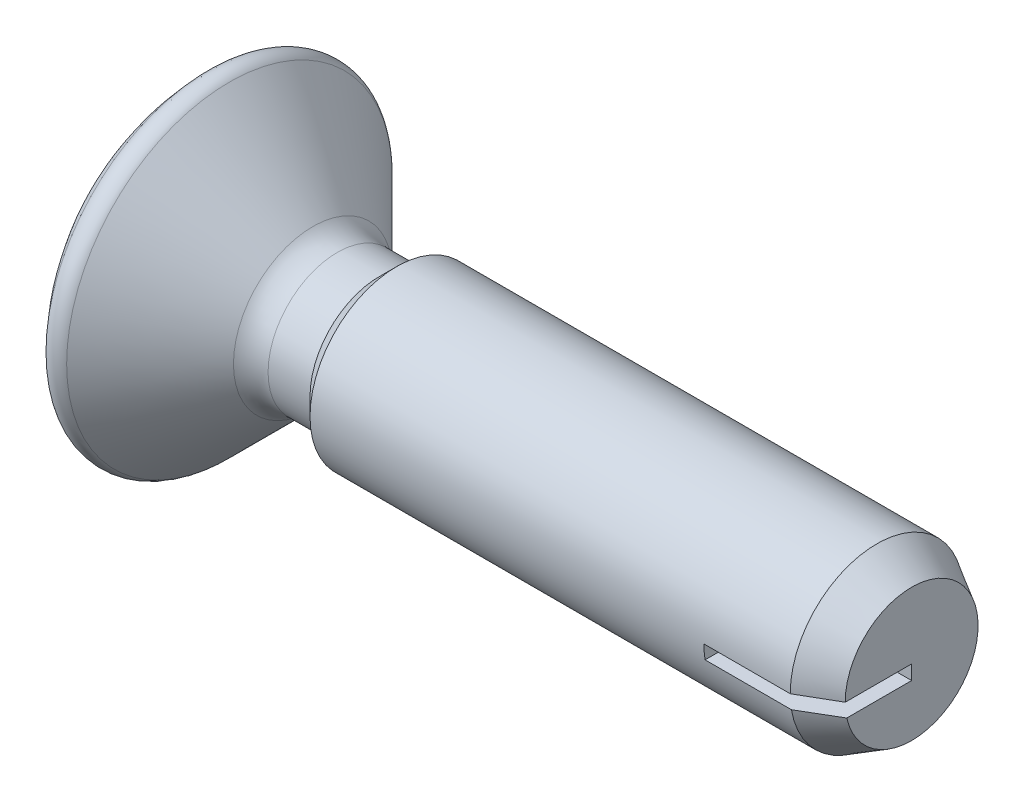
ISO-10303-21;
HEADER;
FILE_DESCRIPTION(('STEP AP214'),'2;1');
FILE_NAME('part.step','',(''),(''),'','','');
FILE_SCHEMA(('AUTOMOTIVE_DESIGN { 1 0 10303 214 1 1 1 1 }'));
ENDSEC;
DATA;
#1=APPLICATION_CONTEXT('core data for automotive mechanical design processes');
#2=APPLICATION_PROTOCOL_DEFINITION('international standard','automotive_design',2000,#1);
#3=PRODUCT_CONTEXT('',#1,'mechanical');
#4=PRODUCT('Part','Part','',(#3));
#5=PRODUCT_RELATED_PRODUCT_CATEGORY('part','',(#4));
#6=PRODUCT_DEFINITION_FORMATION('','',#4);
#7=PRODUCT_DEFINITION_CONTEXT('part definition',#1,'design');
#8=PRODUCT_DEFINITION('design','',#6,#7);
#9=PRODUCT_DEFINITION_SHAPE('','',#8);
#10=(LENGTH_UNIT() NAMED_UNIT(*) SI_UNIT(.MILLI.,.METRE.));
#11=(NAMED_UNIT(*) PLANE_ANGLE_UNIT() SI_UNIT($,.RADIAN.));
#12=(NAMED_UNIT(*) SI_UNIT($,.STERADIAN.) SOLID_ANGLE_UNIT());
#13=UNCERTAINTY_MEASURE_WITH_UNIT(LENGTH_MEASURE(1.E-05),#10,'distance_accuracy_value','');
#14=(GEOMETRIC_REPRESENTATION_CONTEXT(3) GLOBAL_UNCERTAINTY_ASSIGNED_CONTEXT((#13)) GLOBAL_UNIT_ASSIGNED_CONTEXT((#10,
#11,#12)) REPRESENTATION_CONTEXT('',''));
#15=CARTESIAN_POINT('',(0.,0.,0.));
#16=DIRECTION('',(0.,0.,1.));
#17=DIRECTION('',(1.,0.,0.));
#18=AXIS2_PLACEMENT_3D('',#15,#16,#17);
#19=CARTESIAN_POINT('',(0.,0.,0.));
#20=DIRECTION('',(-1.,0.,0.));
#21=DIRECTION('',(0.,0.,1.));
#22=AXIS2_PLACEMENT_3D('',#19,#20,#21);
#23=CYLINDRICAL_SURFACE('',#22,2.);
#24=CARTESIAN_POINT('',(4.1,0.,0.));
#25=DIRECTION('',(-1.,0.,0.));
#26=DIRECTION('',(0.,0.,1.));
#27=AXIS2_PLACEMENT_3D('',#24,#25,#26);
#28=CIRCLE('',#27,2.);
#29=CARTESIAN_POINT('',(4.1,0.,2.));
#30=VERTEX_POINT('',#29);
#31=EDGE_CURVE('E161',#30,#30,#28,.T.);
#32=ORIENTED_EDGE('',*,*,#31,.F.);
#33=EDGE_LOOP('',(#32));
#34=FACE_BOUND('',#33,.T.);
#35=DIRECTION('',(-1.,0.,0.));
#36=VECTOR('',#35,1.);
#37=CARTESIAN_POINT('',(0.,0.,2.));
#38=LINE('',#37,#36);
#39=CARTESIAN_POINT('',(15.1945963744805,0.,2.));
#40=VERTEX_POINT('',#39);
#41=CARTESIAN_POINT('',(13.2,0.,2.));
#42=VERTEX_POINT('',#41);
#43=EDGE_CURVE('E187',#40,#42,#38,.T.);
#44=ORIENTED_EDGE('',*,*,#43,.F.);
#45=CARTESIAN_POINT('',(15.1945963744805,0.,0.));
#46=DIRECTION('',(-1.,0.,0.));
#47=DIRECTION('',(0.,0.,1.));
#48=AXIS2_PLACEMENT_3D('',#45,#46,#47);
#49=CIRCLE('',#48,2.);
#50=CARTESIAN_POINT('',(15.1945963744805,-0.333333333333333,1.97202659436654));
#51=VERTEX_POINT('',#50);
#52=EDGE_CURVE('E184',#40,#51,#49,.T.);
#53=ORIENTED_EDGE('',*,*,#52,.T.);
#54=DIRECTION('',(-1.,0.,0.));
#55=VECTOR('',#54,1.);
#56=CARTESIAN_POINT('',(0.,-0.333333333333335,1.97202659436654));
#57=LINE('',#56,#55);
#58=CARTESIAN_POINT('',(13.2,-0.333333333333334,1.97202659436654));
#59=VERTEX_POINT('',#58);
#60=EDGE_CURVE('E191',#59,#51,#57,.F.);
#61=ORIENTED_EDGE('',*,*,#60,.F.);
#62=CARTESIAN_POINT('',(13.2,0.,0.));
#63=DIRECTION('',(1.,0.,0.));
#64=DIRECTION('',(0.,0.,-1.));
#65=AXIS2_PLACEMENT_3D('',#62,#63,#64);
#66=CIRCLE('',#65,2.);
#67=EDGE_CURVE('E43',#42,#59,#66,.T.);
#68=ORIENTED_EDGE('',*,*,#67,.F.);
#69=EDGE_LOOP('',(#44,#53,#61,#68));
#70=FACE_BOUND('',#69,.T.);
#71=ADVANCED_FACE('F70',(#34,#70),#23,.T.);
#72=CARTESIAN_POINT('',(15.1945963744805,0.,0.));
#73=DIRECTION('',(-1.,0.,0.));
#74=DIRECTION('',(0.,0.,1.));
#75=AXIS2_PLACEMENT_3D('',#72,#73,#74);
#76=CONICAL_SURFACE('',#75,2.,0.523598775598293);
#77=ORIENTED_EDGE('',*,*,#52,.F.);
#78=DIRECTION('',(-0.866025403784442,0.,0.499999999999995));
#79=VECTOR('',#78,1.);
#80=CARTESIAN_POINT('',(18.6586979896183,0.,0.));
#81=LINE('',#80,#79);
#82=CARTESIAN_POINT('',(16.,0.,1.535));
#83=VERTEX_POINT('',#82);
#84=EDGE_CURVE('E189',#40,#83,#81,.F.);
#85=ORIENTED_EDGE('',*,*,#84,.T.);
#86=CARTESIAN_POINT('',(16.,0.,0.));
#87=DIRECTION('',(-1.,0.,0.));
#88=DIRECTION('',(0.,0.,1.));
#89=AXIS2_PLACEMENT_3D('',#86,#87,#88);
#90=CIRCLE('',#89,1.535);
#91=CARTESIAN_POINT('',(16.,-0.333333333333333,1.49837041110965));
#92=VERTEX_POINT('',#91);
#93=EDGE_CURVE('E147',#83,#92,#90,.T.);
#94=ORIENTED_EDGE('',*,*,#93,.T.);
#95=CARTESIAN_POINT('',(17.7245765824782,-0.333333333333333,0.423969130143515));
#96=CARTESIAN_POINT('',(17.7003740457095,-0.333333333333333,0.441731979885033));
#97=CARTESIAN_POINT('',(17.6759825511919,-0.333333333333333,0.459232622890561));
#98=CARTESIAN_POINT('',(17.6269078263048,-0.333333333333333,0.49381503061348));
#99=CARTESIAN_POINT('',(17.6022246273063,-0.333333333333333,0.510896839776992));
#100=CARTESIAN_POINT('',(17.5278722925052,-0.333333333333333,0.561668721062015));
#101=CARTESIAN_POINT('',(17.4778872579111,-0.333333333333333,0.594894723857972));
#102=CARTESIAN_POINT('',(17.3774348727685,-0.333333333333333,0.660556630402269));
#103=CARTESIAN_POINT('',(17.3269677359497,-0.333333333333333,0.692992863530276));
#104=CARTESIAN_POINT('',(17.2256954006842,-0.333333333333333,0.757342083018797));
#105=CARTESIAN_POINT('',(17.1748901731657,-0.333333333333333,0.789255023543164));
#106=CARTESIAN_POINT('',(17.0279577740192,-0.333333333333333,0.880817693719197));
#107=CARTESIAN_POINT('',(16.9315407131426,-0.333333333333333,0.940001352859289));
#108=CARTESIAN_POINT('',(16.7382584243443,-0.333333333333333,1.0576330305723));
#109=CARTESIAN_POINT('',(16.6413931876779,-0.333333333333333,1.11608103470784));
#110=CARTESIAN_POINT('',(16.3503178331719,-0.333333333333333,1.29078741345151));
#111=CARTESIAN_POINT('',(16.1556992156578,-0.333333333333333,1.40636454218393));
#112=CARTESIAN_POINT('',(15.8117855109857,-0.333333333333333,1.60961313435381));
#113=CARTESIAN_POINT('',(15.6625918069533,-0.333333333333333,1.69745704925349));
#114=CARTESIAN_POINT('',(15.3640150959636,-0.333333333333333,1.87282276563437));
#115=CARTESIAN_POINT('',(15.2146320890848,-0.333333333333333,1.96034456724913));
#116=CARTESIAN_POINT('',(14.9158541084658,-0.333333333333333,2.1351138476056));
#117=CARTESIAN_POINT('',(14.7664592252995,-0.333333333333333,2.22236148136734));
#118=CARTESIAN_POINT('',(14.467580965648,-0.333333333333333,2.3967043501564));
#119=CARTESIAN_POINT('',(14.318097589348,-0.333333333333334,2.48379958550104));
#120=CARTESIAN_POINT('',(14.1685865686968,-0.333333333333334,2.5708472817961));
#121=B_SPLINE_CURVE_WITH_KNOTS('',3,(#95,#96,#97,#98,#99,#100,#101,#102,#103,#104,#105,#106,
#107,#108,#109,#110,#111,#112,#113,#114,#115,#116,#117,#118,#119,#120),.UNSPECIFIED.,.F.,.F.,(4,
2,2,2,2,2,2,2,2,2,2,2,4),(0.,0.0900582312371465,0.180106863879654,0.360155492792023,
0.540127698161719,0.720115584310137,1.05950608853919,1.39890324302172,2.07794788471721,
2.59734938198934,3.11675066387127,3.63576777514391,4.15478380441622),.UNSPECIFIED.);
#122=EDGE_CURVE('E193',#92,#51,#121,.T.);
#123=ORIENTED_EDGE('',*,*,#122,.T.);
#124=EDGE_LOOP('',(#77,#85,#94,#123));
#125=FACE_BOUND('',#124,.T.);
#126=ADVANCED_FACE('F203',(#125),#76,.T.);
#127=CARTESIAN_POINT('',(16.,2.,0.));
#128=DIRECTION('',(-1.,0.,0.));
#129=DIRECTION('',(0.,0.,1.));
#130=AXIS2_PLACEMENT_3D('',#127,#128,#129);
#131=PLANE('',#130);
#132=DIRECTION('',(0.,0.,1.));
#133=VECTOR('',#132,1.);
#134=CARTESIAN_POINT('',(16.,0.,0.));
#135=LINE('',#134,#133);
#136=CARTESIAN_POINT('',(16.,0.,0.));
#137=VERTEX_POINT('',#136);
#138=EDGE_CURVE('E78',#137,#83,#135,.T.);
#139=ORIENTED_EDGE('',*,*,#138,.F.);
#140=DIRECTION('',(0.,1.,0.));
#141=VECTOR('',#140,1.);
#142=CARTESIAN_POINT('',(16.,0.,0.));
#143=LINE('',#142,#141);
#144=CARTESIAN_POINT('',(16.,-0.333333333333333,0.));
#145=VERTEX_POINT('',#144);
#146=EDGE_CURVE('E137',#145,#137,#143,.T.);
#147=ORIENTED_EDGE('',*,*,#146,.F.);
#148=DIRECTION('',(0.,0.,-1.));
#149=VECTOR('',#148,1.);
#150=CARTESIAN_POINT('',(16.,-0.333333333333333,0.));
#151=LINE('',#150,#149);
#152=EDGE_CURVE('E148',#92,#145,#151,.T.);
#153=ORIENTED_EDGE('',*,*,#152,.F.);
#154=ORIENTED_EDGE('',*,*,#93,.F.);
#155=EDGE_LOOP('',(#139,#147,#153,#154));
#156=FACE_BOUND('',#155,.T.);
#157=ADVANCED_FACE('F145',(#156),#131,.F.);
#158=CARTESIAN_POINT('',(3.75756413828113,0.,0.));
#159=DIRECTION('',(-1.,0.,0.));
#160=DIRECTION('',(0.,1.,0.));
#161=AXIS2_PLACEMENT_3D('',#158,#159,#160);
#162=SPHERICAL_SURFACE('',#161,5.48810424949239);
#163=CARTESIAN_POINT('',(-0.730540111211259,0.,0.));
#164=DIRECTION('',(1.,0.,0.));
#165=DIRECTION('',(0.,0.,-1.));
#166=AXIS2_PLACEMENT_3D('',#163,#164,#165);
#167=CIRCLE('',#166,3.15851365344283);
#168=CARTESIAN_POINT('',(-0.730540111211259,-0.6,-3.1010012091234));
#169=VERTEX_POINT('',#168);
#170=CARTESIAN_POINT('',(-0.730540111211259,0.6,-3.1010012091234));
#171=VERTEX_POINT('',#170);
#172=EDGE_CURVE('E155',#169,#171,#167,.T.);
#173=ORIENTED_EDGE('',*,*,#172,.T.);
#174=CARTESIAN_POINT('',(3.75756413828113,0.6,0.));
#175=DIRECTION('',(0.,1.,0.));
#176=DIRECTION('',(0.,0.,1.));
#177=AXIS2_PLACEMENT_3D('',#174,#175,#176);
#178=CIRCLE('',#177,5.45520744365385);
#179=CARTESIAN_POINT('',(-0.730540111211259,0.6,3.1010012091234));
#180=VERTEX_POINT('',#179);
#181=EDGE_CURVE('E149',#171,#180,#178,.T.);
#182=ORIENTED_EDGE('',*,*,#181,.T.);
#183=CARTESIAN_POINT('',(-0.730540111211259,-0.6,3.1010012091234));
#184=VERTEX_POINT('',#183);
#185=EDGE_CURVE('E154',#180,#184,#167,.T.);
#186=ORIENTED_EDGE('',*,*,#185,.T.);
#187=CARTESIAN_POINT('',(3.75756413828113,-0.6,0.));
#188=DIRECTION('',(0.,-1.,0.));
#189=DIRECTION('',(0.,0.,-1.));
#190=AXIS2_PLACEMENT_3D('',#187,#188,#189);
#191=CIRCLE('',#190,5.45520744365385);
#192=EDGE_CURVE('E158',#184,#169,#191,.T.);
#193=ORIENTED_EDGE('',*,*,#192,.T.);
#194=EDGE_LOOP('',(#173,#182,#186,#193));
#195=FACE_BOUND('',#194,.T.);
#196=CARTESIAN_POINT('',(-0.246219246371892,0.,0.));
#197=DIRECTION('',(-1.,0.,0.));
#198=DIRECTION('',(0.,0.,1.));
#199=AXIS2_PLACEMENT_3D('',#196,#197,#198);
#200=CIRCLE('',#199,3.75353258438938);
#201=CARTESIAN_POINT('',(-0.246219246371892,0.,3.75353258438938));
#202=VERTEX_POINT('',#201);
#203=EDGE_CURVE('E176',#202,#202,#200,.T.);
#204=ORIENTED_EDGE('',*,*,#203,.T.);
#205=EDGE_LOOP('',(#204));
#206=FACE_BOUND('',#205,.T.);
#207=ADVANCED_FACE('F72',(#195,#206),#162,.T.);
#208=CARTESIAN_POINT('',(4.1,0.,0.));
#209=DIRECTION('',(1.,0.,0.));
#210=DIRECTION('',(0.,0.,-1.));
#211=AXIS2_PLACEMENT_3D('',#208,#209,#210);
#212=CONICAL_SURFACE('',#211,2.,0.785398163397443);
#213=CARTESIAN_POINT('',(3.7,0.,0.));
#214=DIRECTION('',(-1.,0.,0.));
#215=DIRECTION('',(0.,0.,1.));
#216=AXIS2_PLACEMENT_3D('',#213,#214,#215);
#217=CIRCLE('',#216,1.6);
#218=CARTESIAN_POINT('',(3.7,0.,1.6));
#219=VERTEX_POINT('',#218);
#220=EDGE_CURVE('E164',#219,#219,#217,.T.);
#221=ORIENTED_EDGE('',*,*,#220,.F.);
#222=EDGE_LOOP('',(#221));
#223=FACE_BOUND('',#222,.T.);
#224=ORIENTED_EDGE('',*,*,#31,.T.);
#225=EDGE_LOOP('',(#224));
#226=FACE_BOUND('',#225,.T.);
#227=ADVANCED_FACE('F230',(#223,#226),#212,.T.);
#228=CARTESIAN_POINT('',(0.,0.,0.));
#229=DIRECTION('',(-1.,0.,0.));
#230=DIRECTION('',(0.,0.,1.));
#231=AXIS2_PLACEMENT_3D('',#228,#229,#230);
#232=CYLINDRICAL_SURFACE('',#231,1.6);
#233=CARTESIAN_POINT('',(2.73137084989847,0.,0.));
#234=DIRECTION('',(-1.,0.,0.));
#235=DIRECTION('',(0.,0.,1.));
#236=AXIS2_PLACEMENT_3D('',#233,#234,#235);
#237=CIRCLE('',#236,1.6);
#238=CARTESIAN_POINT('',(2.73137084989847,0.,1.6));
#239=VERTEX_POINT('',#238);
#240=EDGE_CURVE('E167',#239,#239,#237,.T.);
#241=ORIENTED_EDGE('',*,*,#240,.F.);
#242=EDGE_LOOP('',(#241));
#243=FACE_BOUND('',#242,.T.);
#244=ORIENTED_EDGE('',*,*,#220,.T.);
#245=EDGE_LOOP('',(#244));
#246=FACE_BOUND('',#245,.T.);
#247=ADVANCED_FACE('F240',(#243,#246),#232,.T.);
#248=CARTESIAN_POINT('',(2.73137084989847,0.,0.));
#249=DIRECTION('',(-1.,0.,0.));
#250=DIRECTION('',(0.,0.,1.));
#251=AXIS2_PLACEMENT_3D('',#248,#249,#250);
#252=TOROIDAL_SURFACE('',#251,2.4,0.8);
#253=CARTESIAN_POINT('',(2.16568542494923,0.,0.));
#254=DIRECTION('',(-1.,0.,0.));
#255=DIRECTION('',(0.,0.,1.));
#256=AXIS2_PLACEMENT_3D('',#253,#254,#255);
#257=CIRCLE('',#256,1.83431457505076);
#258=CARTESIAN_POINT('',(2.16568542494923,0.,1.83431457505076));
#259=VERTEX_POINT('',#258);
#260=EDGE_CURVE('E170',#259,#259,#257,.T.);
#261=ORIENTED_EDGE('',*,*,#260,.F.);
#262=EDGE_LOOP('',(#261));
#263=FACE_BOUND('',#262,.T.);
#264=ORIENTED_EDGE('',*,*,#240,.T.);
#265=EDGE_LOOP('',(#264));
#266=FACE_BOUND('',#265,.T.);
#267=ADVANCED_FACE('F255',(#263,#266),#252,.F.);
#268=CARTESIAN_POINT('',(2.16568542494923,0.,0.));
#269=DIRECTION('',(-1.,0.,0.));
#270=DIRECTION('',(0.,0.,1.));
#271=AXIS2_PLACEMENT_3D('',#268,#269,#270);
#272=CONICAL_SURFACE('',#271,1.83431457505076,0.78539816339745);
#273=CARTESIAN_POINT('',(0.23864853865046,0.,0.));
#274=DIRECTION('',(-1.,0.,0.));
#275=DIRECTION('',(0.,0.,1.));
#276=AXIS2_PLACEMENT_3D('',#273,#274,#275);
#277=CIRCLE('',#276,3.76135146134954);
#278=CARTESIAN_POINT('',(0.23864853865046,0.,3.76135146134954));
#279=VERTEX_POINT('',#278);
#280=EDGE_CURVE('E173',#279,#279,#277,.T.);
#281=ORIENTED_EDGE('',*,*,#280,.F.);
#282=EDGE_LOOP('',(#281));
#283=FACE_BOUND('',#282,.T.);
#284=ORIENTED_EDGE('',*,*,#260,.T.);
#285=EDGE_LOOP('',(#284));
#286=FACE_BOUND('',#285,.T.);
#287=ADVANCED_FACE('F249',(#283,#286),#272,.T.);
#288=CARTESIAN_POINT('',(0.,0.,0.));
#289=DIRECTION('',(-1.,0.,0.));
#290=DIRECTION('',(0.,0.,1.));
#291=AXIS2_PLACEMENT_3D('',#288,#289,#290);
#292=TOROIDAL_SURFACE('',#291,3.52270292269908,0.337499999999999);
#293=ORIENTED_EDGE('',*,*,#203,.F.);
#294=EDGE_LOOP('',(#293));
#295=FACE_BOUND('',#294,.T.);
#296=ORIENTED_EDGE('',*,*,#280,.T.);
#297=EDGE_LOOP('',(#296));
#298=FACE_BOUND('',#297,.T.);
#299=ADVANCED_FACE('F245',(#295,#298),#292,.T.);
#300=CARTESIAN_POINT('',(-1.73054011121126,0.6,-3.86020292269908));
#301=DIRECTION('',(0.,1.,0.));
#302=DIRECTION('',(0.,0.,1.));
#303=AXIS2_PLACEMENT_3D('',#300,#301,#302);
#304=PLANE('',#303);
#305=DIRECTION('',(0.,0.,1.));
#306=VECTOR('',#305,1.);
#307=CARTESIAN_POINT('',(-0.730540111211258,0.6,-3.86020292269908));
#308=LINE('',#307,#306);
#309=EDGE_CURVE('E179',#171,#180,#308,.T.);
#310=ORIENTED_EDGE('',*,*,#309,.T.);
#311=ORIENTED_EDGE('',*,*,#181,.F.);
#312=EDGE_LOOP('',(#310,#311));
#313=FACE_BOUND('',#312,.T.);
#314=ADVANCED_FACE('F248',(#313),#304,.F.);
#315=CARTESIAN_POINT('',(-0.730540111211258,0.6,-3.86020292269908));
#316=DIRECTION('',(1.,0.,0.));
#317=DIRECTION('',(0.,0.,-1.));
#318=AXIS2_PLACEMENT_3D('',#315,#316,#317);
#319=PLANE('',#318);
#320=ORIENTED_EDGE('',*,*,#309,.F.);
#321=ORIENTED_EDGE('',*,*,#172,.F.);
#322=DIRECTION('',(0.,0.,1.));
#323=VECTOR('',#322,1.);
#324=CARTESIAN_POINT('',(-0.730540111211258,-0.6,-3.86020292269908));
#325=LINE('',#324,#323);
#326=EDGE_CURVE('E92',#169,#184,#325,.T.);
#327=ORIENTED_EDGE('',*,*,#326,.T.);
#328=ORIENTED_EDGE('',*,*,#185,.F.);
#329=EDGE_LOOP('',(#320,#321,#327,#328));
#330=FACE_BOUND('',#329,.T.);
#331=ADVANCED_FACE('F273',(#330),#319,.F.);
#332=CARTESIAN_POINT('',(-1.73054011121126,-0.6,-3.86020292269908));
#333=DIRECTION('',(0.,-1.,0.));
#334=DIRECTION('',(0.,0.,-1.));
#335=AXIS2_PLACEMENT_3D('',#332,#333,#334);
#336=PLANE('',#335);
#337=ORIENTED_EDGE('',*,*,#326,.F.);
#338=ORIENTED_EDGE('',*,*,#192,.F.);
#339=EDGE_LOOP('',(#337,#338));
#340=FACE_BOUND('',#339,.T.);
#341=ADVANCED_FACE('F215',(#340),#336,.F.);
#342=CARTESIAN_POINT('',(13.2,0.,3.86020292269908));
#343=DIRECTION('',(1.,0.,0.));
#344=DIRECTION('',(0.,0.,-1.));
#345=AXIS2_PLACEMENT_3D('',#342,#343,#344);
#346=PLANE('',#345);
#347=ORIENTED_EDGE('',*,*,#67,.T.);
#348=DIRECTION('',(0.,0.,-1.));
#349=VECTOR('',#348,1.);
#350=CARTESIAN_POINT('',(13.2,-0.333333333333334,3.86020292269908));
#351=LINE('',#350,#349);
#352=CARTESIAN_POINT('',(13.2,-0.333333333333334,0.));
#353=VERTEX_POINT('',#352);
#354=EDGE_CURVE('E374',#59,#353,#351,.T.);
#355=ORIENTED_EDGE('',*,*,#354,.T.);
#356=DIRECTION('',(0.,-1.,0.));
#357=VECTOR('',#356,1.);
#358=CARTESIAN_POINT('',(13.2,0.,0.));
#359=LINE('',#358,#357);
#360=CARTESIAN_POINT('',(13.2,0.,0.));
#361=VERTEX_POINT('',#360);
#362=EDGE_CURVE('E136',#361,#353,#359,.T.);
#363=ORIENTED_EDGE('',*,*,#362,.F.);
#364=DIRECTION('',(0.,0.,-1.));
#365=VECTOR('',#364,1.);
#366=CARTESIAN_POINT('',(13.2,0.,3.86020292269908));
#367=LINE('',#366,#365);
#368=EDGE_CURVE('E134',#42,#361,#367,.T.);
#369=ORIENTED_EDGE('',*,*,#368,.F.);
#370=EDGE_LOOP('',(#347,#355,#363,#369));
#371=FACE_BOUND('',#370,.T.);
#372=ADVANCED_FACE('F213',(#371),#346,.T.);
#373=CARTESIAN_POINT('',(16.,0.,3.86020292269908));
#374=DIRECTION('',(0.,-1.,0.));
#375=DIRECTION('',(1.,0.,0.));
#376=AXIS2_PLACEMENT_3D('',#373,#374,#375);
#377=PLANE('',#376);
#378=ORIENTED_EDGE('',*,*,#43,.T.);
#379=ORIENTED_EDGE('',*,*,#368,.T.);
#380=DIRECTION('',(-1.,0.,0.));
#381=VECTOR('',#380,1.);
#382=CARTESIAN_POINT('',(16.,0.,0.));
#383=LINE('',#382,#381);
#384=EDGE_CURVE('E129',#137,#361,#383,.T.);
#385=ORIENTED_EDGE('',*,*,#384,.F.);
#386=ORIENTED_EDGE('',*,*,#138,.T.);
#387=ORIENTED_EDGE('',*,*,#84,.F.);
#388=EDGE_LOOP('',(#378,#379,#385,#386,#387));
#389=FACE_BOUND('',#388,.T.);
#390=ADVANCED_FACE('F130',(#389),#377,.T.);
#391=CARTESIAN_POINT('',(16.,-0.333333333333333,3.86020292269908));
#392=DIRECTION('',(0.,1.,0.));
#393=DIRECTION('',(-1.,0.,0.));
#394=AXIS2_PLACEMENT_3D('',#391,#392,#393);
#395=PLANE('',#394);
#396=ORIENTED_EDGE('',*,*,#60,.T.);
#397=ORIENTED_EDGE('',*,*,#122,.F.);
#398=ORIENTED_EDGE('',*,*,#152,.T.);
#399=DIRECTION('',(1.,0.,0.));
#400=VECTOR('',#399,1.);
#401=CARTESIAN_POINT('',(16.,-0.333333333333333,0.));
#402=LINE('',#401,#400);
#403=EDGE_CURVE('E85',#353,#145,#402,.T.);
#404=ORIENTED_EDGE('',*,*,#403,.F.);
#405=ORIENTED_EDGE('',*,*,#354,.F.);
#406=EDGE_LOOP('',(#396,#397,#398,#404,#405));
#407=FACE_BOUND('',#406,.T.);
#408=ADVANCED_FACE('F207',(#407),#395,.T.);
#409=CARTESIAN_POINT('',(16.,0.,0.));
#410=DIRECTION('',(0.,0.,-1.));
#411=DIRECTION('',(-1.,0.,0.));
#412=AXIS2_PLACEMENT_3D('',#409,#410,#411);
#413=PLANE('',#412);
#414=ORIENTED_EDGE('',*,*,#146,.T.);
#415=ORIENTED_EDGE('',*,*,#384,.T.);
#416=ORIENTED_EDGE('',*,*,#362,.T.);
#417=ORIENTED_EDGE('',*,*,#403,.T.);
#418=EDGE_LOOP('',(#414,#415,#416,#417));
#419=FACE_BOUND('',#418,.T.);
#420=ADVANCED_FACE('F140',(#419),#413,.F.);
#421=CLOSED_SHELL('',(#71,#126,#157,#207,#227,#247,#267,#287,#299,#314,#331,#341,#372,#390,#408,#420));
#422=MANIFOLD_SOLID_BREP('B6',#421);
#423=ADVANCED_BREP_SHAPE_REPRESENTATION('',(#18,#422),#14);
#424=SHAPE_DEFINITION_REPRESENTATION(#9,#423);
ENDSEC;
END-ISO-10303-21;
